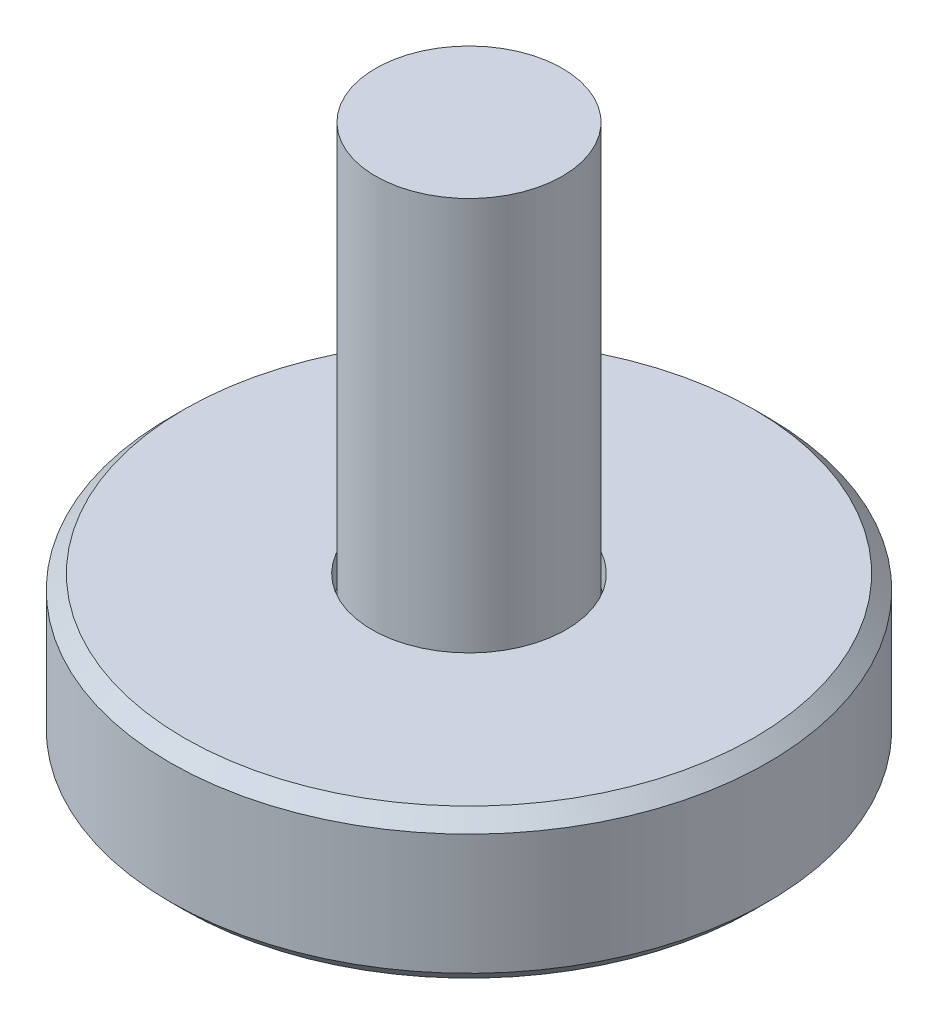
ISO-10303-21;
HEADER;
FILE_DESCRIPTION(('STEP AP214'),'2;1');
FILE_NAME('part.step','',(''),(''),'','','');
FILE_SCHEMA(('AUTOMOTIVE_DESIGN { 1 0 10303 214 1 1 1 1 }'));
ENDSEC;
DATA;
#1=APPLICATION_CONTEXT('core data for automotive mechanical design processes');
#2=APPLICATION_PROTOCOL_DEFINITION('international standard','automotive_design',2000,#1);
#3=PRODUCT_CONTEXT('',#1,'mechanical');
#4=PRODUCT('Part','Part','',(#3));
#5=PRODUCT_RELATED_PRODUCT_CATEGORY('part','',(#4));
#6=PRODUCT_DEFINITION_FORMATION('','',#4);
#7=PRODUCT_DEFINITION_CONTEXT('part definition',#1,'design');
#8=PRODUCT_DEFINITION('design','',#6,#7);
#9=PRODUCT_DEFINITION_SHAPE('','',#8);
#10=(LENGTH_UNIT() NAMED_UNIT(*) SI_UNIT(.MILLI.,.METRE.));
#11=(NAMED_UNIT(*) PLANE_ANGLE_UNIT() SI_UNIT($,.RADIAN.));
#12=(NAMED_UNIT(*) SI_UNIT($,.STERADIAN.) SOLID_ANGLE_UNIT());
#13=UNCERTAINTY_MEASURE_WITH_UNIT(LENGTH_MEASURE(1.E-05),#10,'distance_accuracy_value','');
#14=(GEOMETRIC_REPRESENTATION_CONTEXT(3) GLOBAL_UNCERTAINTY_ASSIGNED_CONTEXT((#13)) GLOBAL_UNIT_ASSIGNED_CONTEXT((#10,
#11,#12)) REPRESENTATION_CONTEXT('',''));
#15=CARTESIAN_POINT('',(0.,0.,0.));
#16=DIRECTION('',(0.,0.,1.));
#17=DIRECTION('',(1.,0.,0.));
#18=AXIS2_PLACEMENT_3D('',#15,#16,#17);
#19=CARTESIAN_POINT('',(0.,14.45,0.));
#20=DIRECTION('',(0.,1.,0.));
#21=DIRECTION('',(1.,0.,0.));
#22=AXIS2_PLACEMENT_3D('',#19,#20,#21);
#23=PLANE('',#22);
#24=CARTESIAN_POINT('',(0.,14.45,0.));
#25=DIRECTION('',(0.,1.,0.));
#26=DIRECTION('',(1.,0.,0.));
#27=AXIS2_PLACEMENT_3D('',#24,#25,#26);
#28=CIRCLE('',#27,2.5);
#29=CARTESIAN_POINT('',(2.5,14.45,0.));
#30=VERTEX_POINT('',#29);
#31=EDGE_CURVE('E12',#30,#30,#28,.T.);
#32=ORIENTED_EDGE('',*,*,#31,.T.);
#33=EDGE_LOOP('',(#32));
#34=FACE_BOUND('',#33,.T.);
#35=ADVANCED_FACE('F47',(#34),#23,.T.);
#36=CARTESIAN_POINT('',(0.,14.45,0.));
#37=DIRECTION('',(0.,1.,0.));
#38=DIRECTION('',(1.,0.,0.));
#39=AXIS2_PLACEMENT_3D('',#36,#37,#38);
#40=CYLINDRICAL_SURFACE('',#39,2.5);
#41=CARTESIAN_POINT('',(0.,3.25,0.));
#42=DIRECTION('',(0.,1.,0.));
#43=DIRECTION('',(1.,0.,0.));
#44=AXIS2_PLACEMENT_3D('',#41,#42,#43);
#45=CIRCLE('',#44,2.5);
#46=CARTESIAN_POINT('',(2.5,3.25,0.));
#47=VERTEX_POINT('',#46);
#48=EDGE_CURVE('E54',#47,#47,#45,.T.);
#49=ORIENTED_EDGE('',*,*,#48,.T.);
#50=EDGE_LOOP('',(#49));
#51=FACE_BOUND('',#50,.T.);
#52=ORIENTED_EDGE('',*,*,#31,.F.);
#53=EDGE_LOOP('',(#52));
#54=FACE_BOUND('',#53,.T.);
#55=ADVANCED_FACE('F161',(#51,#54),#40,.T.);
#56=CARTESIAN_POINT('',(0.,3.25,0.));
#57=DIRECTION('',(0.,-1.,0.));
#58=DIRECTION('',(-1.,0.,0.));
#59=AXIS2_PLACEMENT_3D('',#56,#57,#58);
#60=CONICAL_SURFACE('',#59,2.5,0.78539816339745);
#61=CARTESIAN_POINT('',(0.,0.750000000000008,0.));
#62=DIRECTION('',(0.,1.,0.));
#63=DIRECTION('',(1.,0.,0.));
#64=AXIS2_PLACEMENT_3D('',#61,#62,#63);
#65=CIRCLE('',#64,5.);
#66=CARTESIAN_POINT('',(5.,0.750000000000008,0.));
#67=VERTEX_POINT('',#66);
#68=EDGE_CURVE('E156',#67,#67,#65,.T.);
#69=ORIENTED_EDGE('',*,*,#68,.T.);
#70=EDGE_LOOP('',(#69));
#71=FACE_BOUND('',#70,.T.);
#72=ORIENTED_EDGE('',*,*,#48,.F.);
#73=EDGE_LOOP('',(#72));
#74=FACE_BOUND('',#73,.T.);
#75=ADVANCED_FACE('F164',(#71,#74),#60,.T.);
#76=CARTESIAN_POINT('',(0.,14.45,0.));
#77=DIRECTION('',(0.,1.,0.));
#78=DIRECTION('',(1.,0.,0.));
#79=AXIS2_PLACEMENT_3D('',#76,#77,#78);
#80=CYLINDRICAL_SURFACE('',#79,5.);
#81=CARTESIAN_POINT('',(0.,0.449999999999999,0.));
#82=DIRECTION('',(0.,1.,0.));
#83=DIRECTION('',(1.,0.,0.));
#84=AXIS2_PLACEMENT_3D('',#81,#82,#83);
#85=CIRCLE('',#84,5.);
#86=CARTESIAN_POINT('',(5.,0.449999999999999,0.));
#87=VERTEX_POINT('',#86);
#88=EDGE_CURVE('E148',#87,#87,#85,.T.);
#89=ORIENTED_EDGE('',*,*,#88,.T.);
#90=EDGE_LOOP('',(#89));
#91=FACE_BOUND('',#90,.T.);
#92=ORIENTED_EDGE('',*,*,#68,.F.);
#93=EDGE_LOOP('',(#92));
#94=FACE_BOUND('',#93,.T.);
#95=ADVANCED_FACE('F166',(#91,#94),#80,.T.);
#96=CARTESIAN_POINT('',(0.,0.449999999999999,5.));
#97=DIRECTION('',(0.,-1.,0.));
#98=DIRECTION('',(-1.,0.,0.));
#99=AXIS2_PLACEMENT_3D('',#96,#97,#98);
#100=PLANE('',#99);
#101=DIRECTION('',(0.866025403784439,0.,0.5));
#102=VECTOR('',#101,1.);
#103=CARTESIAN_POINT('',(0.,0.449999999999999,-1.73205080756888));
#104=LINE('',#103,#102);
#105=CARTESIAN_POINT('',(0.,0.449999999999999,-1.73205080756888));
#106=VERTEX_POINT('',#105);
#107=CARTESIAN_POINT('',(1.5,0.449999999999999,-0.866025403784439));
#108=VERTEX_POINT('',#107);
#109=EDGE_CURVE('E61',#106,#108,#104,.T.);
#110=ORIENTED_EDGE('',*,*,#109,.F.);
#111=DIRECTION('',(0.866025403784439,0.,-0.5));
#112=VECTOR('',#111,1.);
#113=CARTESIAN_POINT('',(-1.5,0.449999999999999,-0.866025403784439));
#114=LINE('',#113,#112);
#115=CARTESIAN_POINT('',(-1.5,0.449999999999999,-0.866025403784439));
#116=VERTEX_POINT('',#115);
#117=EDGE_CURVE('E144',#116,#106,#114,.T.);
#118=ORIENTED_EDGE('',*,*,#117,.F.);
#119=DIRECTION('',(0.,0.,-1.));
#120=VECTOR('',#119,1.);
#121=CARTESIAN_POINT('',(-1.5,0.449999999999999,0.866025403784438));
#122=LINE('',#121,#120);
#123=CARTESIAN_POINT('',(-1.5,0.449999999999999,0.866025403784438));
#124=VERTEX_POINT('',#123);
#125=EDGE_CURVE('E142',#124,#116,#122,.T.);
#126=ORIENTED_EDGE('',*,*,#125,.F.);
#127=DIRECTION('',(-0.866025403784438,0.,-0.5));
#128=VECTOR('',#127,1.);
#129=CARTESIAN_POINT('',(0.,0.449999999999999,1.73205080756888));
#130=LINE('',#129,#128);
#131=CARTESIAN_POINT('',(0.,0.449999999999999,1.73205080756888));
#132=VERTEX_POINT('',#131);
#133=EDGE_CURVE('E109',#132,#124,#130,.T.);
#134=ORIENTED_EDGE('',*,*,#133,.F.);
#135=DIRECTION('',(-0.866025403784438,0.,0.5));
#136=VECTOR('',#135,1.);
#137=CARTESIAN_POINT('',(1.5,0.449999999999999,0.866025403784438));
#138=LINE('',#137,#136);
#139=CARTESIAN_POINT('',(1.5,0.449999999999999,0.866025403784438));
#140=VERTEX_POINT('',#139);
#141=EDGE_CURVE('E138',#140,#132,#138,.T.);
#142=ORIENTED_EDGE('',*,*,#141,.F.);
#143=DIRECTION('',(0.,0.,1.));
#144=VECTOR('',#143,1.);
#145=CARTESIAN_POINT('',(1.5,0.449999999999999,-0.866025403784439));
#146=LINE('',#145,#144);
#147=EDGE_CURVE('E135',#108,#140,#146,.T.);
#148=ORIENTED_EDGE('',*,*,#147,.F.);
#149=EDGE_LOOP('',(#110,#118,#126,#134,#142,#148));
#150=FACE_BOUND('',#149,.T.);
#151=ORIENTED_EDGE('',*,*,#88,.F.);
#152=EDGE_LOOP('',(#151));
#153=FACE_BOUND('',#152,.T.);
#154=ADVANCED_FACE('F173',(#150,#153),#100,.T.);
#155=CARTESIAN_POINT('',(0.,2.95,-1.73205080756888));
#156=DIRECTION('',(0.5,0.,-0.866025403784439));
#157=DIRECTION('',(-0.866025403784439,0.,-0.5));
#158=AXIS2_PLACEMENT_3D('',#155,#156,#157);
#159=PLANE('',#158);
#160=ORIENTED_EDGE('',*,*,#109,.T.);
#161=DIRECTION('',(0.,-1.,0.));
#162=VECTOR('',#161,1.);
#163=CARTESIAN_POINT('',(1.5,2.95,-0.866025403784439));
#164=LINE('',#163,#162);
#165=CARTESIAN_POINT('',(1.5,2.95,-0.866025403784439));
#166=VERTEX_POINT('',#165);
#167=EDGE_CURVE('E91',#166,#108,#164,.T.);
#168=ORIENTED_EDGE('',*,*,#167,.F.);
#169=DIRECTION('',(0.866025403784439,0.,0.5));
#170=VECTOR('',#169,1.);
#171=CARTESIAN_POINT('',(0.,2.95,-1.73205080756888));
#172=LINE('',#171,#170);
#173=CARTESIAN_POINT('',(0.,2.95,-1.73205080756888));
#174=VERTEX_POINT('',#173);
#175=EDGE_CURVE('E146',#174,#166,#172,.T.);
#176=ORIENTED_EDGE('',*,*,#175,.F.);
#177=DIRECTION('',(0.,-1.,0.));
#178=VECTOR('',#177,1.);
#179=CARTESIAN_POINT('',(0.,2.95,-1.73205080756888));
#180=LINE('',#179,#178);
#181=EDGE_CURVE('E69',#174,#106,#180,.T.);
#182=ORIENTED_EDGE('',*,*,#181,.T.);
#183=EDGE_LOOP('',(#160,#168,#176,#182));
#184=FACE_BOUND('',#183,.T.);
#185=ADVANCED_FACE('F204',(#184),#159,.F.);
#186=CARTESIAN_POINT('',(-1.5,2.95,-0.866025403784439));
#187=DIRECTION('',(-0.5,0.,-0.866025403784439));
#188=DIRECTION('',(-0.866025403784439,0.,0.5));
#189=AXIS2_PLACEMENT_3D('',#186,#187,#188);
#190=PLANE('',#189);
#191=ORIENTED_EDGE('',*,*,#117,.T.);
#192=ORIENTED_EDGE('',*,*,#181,.F.);
#193=DIRECTION('',(0.866025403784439,0.,-0.5));
#194=VECTOR('',#193,1.);
#195=CARTESIAN_POINT('',(-1.5,2.95,-0.866025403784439));
#196=LINE('',#195,#194);
#197=CARTESIAN_POINT('',(-1.5,2.95,-0.866025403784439));
#198=VERTEX_POINT('',#197);
#199=EDGE_CURVE('E121',#198,#174,#196,.T.);
#200=ORIENTED_EDGE('',*,*,#199,.F.);
#201=DIRECTION('',(0.,-1.,0.));
#202=VECTOR('',#201,1.);
#203=CARTESIAN_POINT('',(-1.5,2.95,-0.866025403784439));
#204=LINE('',#203,#202);
#205=EDGE_CURVE('E113',#198,#116,#204,.T.);
#206=ORIENTED_EDGE('',*,*,#205,.T.);
#207=EDGE_LOOP('',(#191,#192,#200,#206));
#208=FACE_BOUND('',#207,.T.);
#209=ADVANCED_FACE('F214',(#208),#190,.F.);
#210=CARTESIAN_POINT('',(-1.5,2.95,0.866025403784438));
#211=DIRECTION('',(-1.,0.,0.));
#212=DIRECTION('',(0.,0.,1.));
#213=AXIS2_PLACEMENT_3D('',#210,#211,#212);
#214=PLANE('',#213);
#215=ORIENTED_EDGE('',*,*,#125,.T.);
#216=ORIENTED_EDGE('',*,*,#205,.F.);
#217=DIRECTION('',(0.,0.,-1.));
#218=VECTOR('',#217,1.);
#219=CARTESIAN_POINT('',(-1.5,2.95,0.866025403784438));
#220=LINE('',#219,#218);
#221=CARTESIAN_POINT('',(-1.5,2.95,0.866025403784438));
#222=VERTEX_POINT('',#221);
#223=EDGE_CURVE('E117',#222,#198,#220,.T.);
#224=ORIENTED_EDGE('',*,*,#223,.F.);
#225=DIRECTION('',(0.,-1.,0.));
#226=VECTOR('',#225,1.);
#227=CARTESIAN_POINT('',(-1.5,2.95,0.866025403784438));
#228=LINE('',#227,#226);
#229=EDGE_CURVE('E102',#222,#124,#228,.T.);
#230=ORIENTED_EDGE('',*,*,#229,.T.);
#231=EDGE_LOOP('',(#215,#216,#224,#230));
#232=FACE_BOUND('',#231,.T.);
#233=ADVANCED_FACE('F118',(#232),#214,.F.);
#234=CARTESIAN_POINT('',(0.,2.95,1.73205080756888));
#235=DIRECTION('',(-0.5,0.,0.866025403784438));
#236=DIRECTION('',(0.866025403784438,0.,0.5));
#237=AXIS2_PLACEMENT_3D('',#234,#235,#236);
#238=PLANE('',#237);
#239=ORIENTED_EDGE('',*,*,#133,.T.);
#240=ORIENTED_EDGE('',*,*,#229,.F.);
#241=DIRECTION('',(-0.866025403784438,0.,-0.5));
#242=VECTOR('',#241,1.);
#243=CARTESIAN_POINT('',(0.,2.95,1.73205080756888));
#244=LINE('',#243,#242);
#245=CARTESIAN_POINT('',(0.,2.95,1.73205080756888));
#246=VERTEX_POINT('',#245);
#247=EDGE_CURVE('E106',#246,#222,#244,.T.);
#248=ORIENTED_EDGE('',*,*,#247,.F.);
#249=DIRECTION('',(0.,-1.,0.));
#250=VECTOR('',#249,1.);
#251=CARTESIAN_POINT('',(0.,2.95,1.73205080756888));
#252=LINE('',#251,#250);
#253=EDGE_CURVE('E114',#246,#132,#252,.T.);
#254=ORIENTED_EDGE('',*,*,#253,.T.);
#255=EDGE_LOOP('',(#239,#240,#248,#254));
#256=FACE_BOUND('',#255,.T.);
#257=ADVANCED_FACE('F104',(#256),#238,.F.);
#258=CARTESIAN_POINT('',(1.5,2.95,0.866025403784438));
#259=DIRECTION('',(0.5,0.,0.866025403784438));
#260=DIRECTION('',(0.866025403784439,0.,-0.5));
#261=AXIS2_PLACEMENT_3D('',#258,#259,#260);
#262=PLANE('',#261);
#263=ORIENTED_EDGE('',*,*,#141,.T.);
#264=ORIENTED_EDGE('',*,*,#253,.F.);
#265=DIRECTION('',(-0.866025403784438,0.,0.5));
#266=VECTOR('',#265,1.);
#267=CARTESIAN_POINT('',(1.5,2.95,0.866025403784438));
#268=LINE('',#267,#266);
#269=CARTESIAN_POINT('',(1.5,2.95,0.866025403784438));
#270=VERTEX_POINT('',#269);
#271=EDGE_CURVE('E127',#270,#246,#268,.T.);
#272=ORIENTED_EDGE('',*,*,#271,.F.);
#273=DIRECTION('',(0.,-1.,0.));
#274=VECTOR('',#273,1.);
#275=CARTESIAN_POINT('',(1.5,2.95,0.866025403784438));
#276=LINE('',#275,#274);
#277=EDGE_CURVE('E151',#270,#140,#276,.T.);
#278=ORIENTED_EDGE('',*,*,#277,.T.);
#279=EDGE_LOOP('',(#263,#264,#272,#278));
#280=FACE_BOUND('',#279,.T.);
#281=ADVANCED_FACE('F239',(#280),#262,.F.);
#282=CARTESIAN_POINT('',(1.5,2.95,-0.866025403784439));
#283=DIRECTION('',(1.,0.,0.));
#284=DIRECTION('',(0.,-1.,0.));
#285=AXIS2_PLACEMENT_3D('',#282,#283,#284);
#286=PLANE('',#285);
#287=ORIENTED_EDGE('',*,*,#147,.T.);
#288=ORIENTED_EDGE('',*,*,#277,.F.);
#289=DIRECTION('',(0.,0.,1.));
#290=VECTOR('',#289,1.);
#291=CARTESIAN_POINT('',(1.5,2.95,-0.866025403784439));
#292=LINE('',#291,#290);
#293=EDGE_CURVE('E129',#166,#270,#292,.T.);
#294=ORIENTED_EDGE('',*,*,#293,.F.);
#295=ORIENTED_EDGE('',*,*,#167,.T.);
#296=EDGE_LOOP('',(#287,#288,#294,#295));
#297=FACE_BOUND('',#296,.T.);
#298=ADVANCED_FACE('F248',(#297),#286,.F.);
#299=CARTESIAN_POINT('',(3.,2.95,0.));
#300=DIRECTION('',(0.,-1.,0.));
#301=DIRECTION('',(-1.,0.,0.));
#302=AXIS2_PLACEMENT_3D('',#299,#300,#301);
#303=PLANE('',#302);
#304=ORIENTED_EDGE('',*,*,#175,.T.);
#305=ORIENTED_EDGE('',*,*,#293,.T.);
#306=ORIENTED_EDGE('',*,*,#271,.T.);
#307=ORIENTED_EDGE('',*,*,#247,.T.);
#308=ORIENTED_EDGE('',*,*,#223,.T.);
#309=ORIENTED_EDGE('',*,*,#199,.T.);
#310=EDGE_LOOP('',(#304,#305,#306,#307,#308,#309));
#311=FACE_BOUND('',#310,.T.);
#312=ADVANCED_FACE('F124',(#311),#303,.T.);
#313=CLOSED_SHELL('',(#35,#55,#75,#95,#154,#185,#209,#233,#257,#281,#298,#312));
#314=MANIFOLD_SOLID_BREP('B2',#313);
#315=CARTESIAN_POINT('',(0.,3.9878,0.));
#316=DIRECTION('',(0.,-1.,0.));
#317=DIRECTION('',(0.,0.,-1.));
#318=AXIS2_PLACEMENT_3D('',#315,#316,#317);
#319=CYLINDRICAL_SURFACE('',#318,8.001);
#320=CARTESIAN_POINT('',(0.,0.381000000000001,0.));
#321=DIRECTION('',(0.,1.,0.));
#322=DIRECTION('',(0.,0.,1.));
#323=AXIS2_PLACEMENT_3D('',#320,#321,#322);
#324=CIRCLE('',#323,8.001);
#325=CARTESIAN_POINT('',(0.,0.381000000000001,8.001));
#326=VERTEX_POINT('',#325);
#327=EDGE_CURVE('E294',#326,#326,#324,.T.);
#328=ORIENTED_EDGE('',*,*,#327,.T.);
#329=EDGE_LOOP('',(#328));
#330=FACE_BOUND('',#329,.T.);
#331=CARTESIAN_POINT('',(0.,3.60679999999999,0.));
#332=DIRECTION('',(0.,1.,0.));
#333=DIRECTION('',(0.,0.,1.));
#334=AXIS2_PLACEMENT_3D('',#331,#332,#333);
#335=CIRCLE('',#334,8.001);
#336=CARTESIAN_POINT('',(0.,3.60679999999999,-8.001));
#337=VERTEX_POINT('',#336);
#338=EDGE_CURVE('E298',#337,#337,#335,.F.);
#339=ORIENTED_EDGE('',*,*,#338,.T.);
#340=EDGE_LOOP('',(#339));
#341=FACE_BOUND('',#340,.T.);
#342=ADVANCED_FACE('F283',(#330,#341),#319,.T.);
#343=CARTESIAN_POINT('',(0.,3.9878,0.));
#344=DIRECTION('',(0.,1.,0.));
#345=DIRECTION('',(0.,0.,1.));
#346=AXIS2_PLACEMENT_3D('',#343,#344,#345);
#347=PLANE('',#346);
#348=CARTESIAN_POINT('',(0.,3.9878,0.));
#349=DIRECTION('',(0.,-1.,0.));
#350=DIRECTION('',(0.,0.,-1.));
#351=AXIS2_PLACEMENT_3D('',#348,#349,#350);
#352=CIRCLE('',#351,2.6);
#353=CARTESIAN_POINT('',(0.,3.9878,-2.6));
#354=VERTEX_POINT('',#353);
#355=EDGE_CURVE('E309',#354,#354,#352,.T.);
#356=ORIENTED_EDGE('',*,*,#355,.T.);
#357=EDGE_LOOP('',(#356));
#358=FACE_BOUND('',#357,.T.);
#359=CARTESIAN_POINT('',(0.,3.9878,0.));
#360=DIRECTION('',(0.,1.,0.));
#361=DIRECTION('',(0.,0.,1.));
#362=AXIS2_PLACEMENT_3D('',#359,#360,#361);
#363=CIRCLE('',#362,7.61999999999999);
#364=CARTESIAN_POINT('',(0.,3.9878,-7.61999999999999));
#365=VERTEX_POINT('',#364);
#366=EDGE_CURVE('E46',#365,#365,#363,.T.);
#367=ORIENTED_EDGE('',*,*,#366,.T.);
#368=EDGE_LOOP('',(#367));
#369=FACE_BOUND('',#368,.T.);
#370=ADVANCED_FACE('F313',(#358,#369),#347,.T.);
#371=CARTESIAN_POINT('',(0.,0.,0.));
#372=DIRECTION('',(0.,1.,0.));
#373=DIRECTION('',(0.,0.,1.));
#374=AXIS2_PLACEMENT_3D('',#371,#372,#373);
#375=PLANE('',#374);
#376=CARTESIAN_POINT('',(0.,0.,0.));
#377=DIRECTION('',(0.,-1.,0.));
#378=DIRECTION('',(0.,0.,-1.));
#379=AXIS2_PLACEMENT_3D('',#376,#377,#378);
#380=CIRCLE('',#379,5.75000000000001);
#381=CARTESIAN_POINT('',(0.,0.,-5.75000000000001));
#382=VERTEX_POINT('',#381);
#383=EDGE_CURVE('E303',#382,#382,#380,.T.);
#384=ORIENTED_EDGE('',*,*,#383,.F.);
#385=EDGE_LOOP('',(#384));
#386=FACE_BOUND('',#385,.T.);
#387=CARTESIAN_POINT('',(0.,0.,0.));
#388=DIRECTION('',(0.,1.,0.));
#389=DIRECTION('',(0.,0.,1.));
#390=AXIS2_PLACEMENT_3D('',#387,#388,#389);
#391=CIRCLE('',#390,7.62);
#392=CARTESIAN_POINT('',(0.,0.,7.62));
#393=VERTEX_POINT('',#392);
#394=EDGE_CURVE('E290',#393,#393,#391,.F.);
#395=ORIENTED_EDGE('',*,*,#394,.T.);
#396=EDGE_LOOP('',(#395));
#397=FACE_BOUND('',#396,.T.);
#398=ADVANCED_FACE('F327',(#386,#397),#375,.F.);
#399=CARTESIAN_POINT('',(0.,0.381000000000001,0.));
#400=DIRECTION('',(0.,1.,0.));
#401=DIRECTION('',(0.,0.,1.));
#402=AXIS2_PLACEMENT_3D('',#399,#400,#401);
#403=CONICAL_SURFACE('',#402,8.001,0.785398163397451);
#404=ORIENTED_EDGE('',*,*,#394,.F.);
#405=EDGE_LOOP('',(#404));
#406=FACE_BOUND('',#405,.T.);
#407=ORIENTED_EDGE('',*,*,#327,.F.);
#408=EDGE_LOOP('',(#407));
#409=FACE_BOUND('',#408,.T.);
#410=ADVANCED_FACE('F329',(#406,#409),#403,.T.);
#411=CARTESIAN_POINT('',(0.,3.9878,0.));
#412=DIRECTION('',(0.,-1.,0.));
#413=DIRECTION('',(0.,0.,-1.));
#414=AXIS2_PLACEMENT_3D('',#411,#412,#413);
#415=CONICAL_SURFACE('',#414,7.61999999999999,0.785398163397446);
#416=CARTESIAN_POINT('',(0.,3.60679999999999,-8.001));
#417=CARTESIAN_POINT('',(0.,3.61076874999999,-7.99703125));
#418=CARTESIAN_POINT('',(0.,3.61473749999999,-7.9930625));
#419=CARTESIAN_POINT('',(0.,3.62267499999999,-7.985125));
#420=CARTESIAN_POINT('',(0.,3.62664374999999,-7.98115625));
#421=CARTESIAN_POINT('',(0.,3.63458124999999,-7.97321875));
#422=CARTESIAN_POINT('',(0.,3.63854999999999,-7.96925));
#423=CARTESIAN_POINT('',(0.,3.64648749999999,-7.9613125));
#424=CARTESIAN_POINT('',(0.,3.65045624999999,-7.95734375));
#425=CARTESIAN_POINT('',(0.,3.65839374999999,-7.94940625));
#426=CARTESIAN_POINT('',(0.,3.66236249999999,-7.9454375));
#427=CARTESIAN_POINT('',(0.,3.67029999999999,-7.9375));
#428=CARTESIAN_POINT('',(0.,3.67426874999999,-7.93353125));
#429=CARTESIAN_POINT('',(0.,3.68220624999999,-7.92559375));
#430=CARTESIAN_POINT('',(0.,3.68617499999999,-7.921625));
#431=CARTESIAN_POINT('',(0.,3.69411249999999,-7.9136875));
#432=CARTESIAN_POINT('',(0.,3.69808124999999,-7.90971875));
#433=CARTESIAN_POINT('',(0.,3.70601874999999,-7.90178125));
#434=CARTESIAN_POINT('',(0.,3.70998749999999,-7.8978125));
#435=CARTESIAN_POINT('',(0.,3.71792499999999,-7.889875));
#436=CARTESIAN_POINT('',(0.,3.72189374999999,-7.88590625));
#437=CARTESIAN_POINT('',(0.,3.72983124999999,-7.87796875));
#438=CARTESIAN_POINT('',(0.,3.7338,-7.874));
#439=CARTESIAN_POINT('',(0.,3.7417375,-7.8660625));
#440=CARTESIAN_POINT('',(0.,3.74570625,-7.86209375));
#441=CARTESIAN_POINT('',(0.,3.75364375,-7.85415625));
#442=CARTESIAN_POINT('',(0.,3.7576125,-7.8501875));
#443=CARTESIAN_POINT('',(0.,3.76555,-7.84225));
#444=CARTESIAN_POINT('',(0.,3.76951875,-7.83828125));
#445=CARTESIAN_POINT('',(0.,3.77745625,-7.83034375));
#446=CARTESIAN_POINT('',(0.,3.781425,-7.826375));
#447=CARTESIAN_POINT('',(0.,3.7893625,-7.8184375));
#448=CARTESIAN_POINT('',(0.,3.79333125,-7.81446875));
#449=CARTESIAN_POINT('',(0.,3.80126875,-7.80653125));
#450=CARTESIAN_POINT('',(0.,3.8052375,-7.8025625));
#451=CARTESIAN_POINT('',(0.,3.813175,-7.794625));
#452=CARTESIAN_POINT('',(0.,3.81714375,-7.79065625));
#453=CARTESIAN_POINT('',(0.,3.82508125,-7.78271875));
#454=CARTESIAN_POINT('',(0.,3.82905,-7.77875));
#455=CARTESIAN_POINT('',(0.,3.8369875,-7.7708125));
#456=CARTESIAN_POINT('',(0.,3.84095625,-7.76684375));
#457=CARTESIAN_POINT('',(0.,3.84889375,-7.75890625));
#458=CARTESIAN_POINT('',(0.,3.8528625,-7.7549375));
#459=CARTESIAN_POINT('',(0.,3.8608,-7.747));
#460=CARTESIAN_POINT('',(0.,3.86476875,-7.74303125));
#461=CARTESIAN_POINT('',(0.,3.87270625,-7.73509375));
#462=CARTESIAN_POINT('',(0.,3.876675,-7.731125));
#463=CARTESIAN_POINT('',(0.,3.8846125,-7.7231875));
#464=CARTESIAN_POINT('',(0.,3.88858125,-7.71921875));
#465=CARTESIAN_POINT('',(0.,3.89651875,-7.71128125));
#466=CARTESIAN_POINT('',(0.,3.9004875,-7.7073125));
#467=CARTESIAN_POINT('',(0.,3.908425,-7.699375));
#468=CARTESIAN_POINT('',(0.,3.91239375,-7.69540625));
#469=CARTESIAN_POINT('',(0.,3.92033125,-7.68746875));
#470=CARTESIAN_POINT('',(0.,3.9243,-7.6835));
#471=CARTESIAN_POINT('',(0.,3.9322375,-7.6755625));
#472=CARTESIAN_POINT('',(0.,3.93620625,-7.67159375));
#473=CARTESIAN_POINT('',(0.,3.94414375,-7.66365625));
#474=CARTESIAN_POINT('',(0.,3.9481125,-7.6596875));
#475=CARTESIAN_POINT('',(0.,3.95605,-7.65175));
#476=CARTESIAN_POINT('',(0.,3.96001875,-7.64778125));
#477=CARTESIAN_POINT('',(0.,3.96795625,-7.63984375));
#478=CARTESIAN_POINT('',(0.,3.971925,-7.635875));
#479=CARTESIAN_POINT('',(0.,3.9798625,-7.6279375));
#480=CARTESIAN_POINT('',(0.,3.98383125,-7.62396875));
#481=CARTESIAN_POINT('',(0.,3.9878,-7.61999999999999));
#482=B_SPLINE_CURVE_WITH_KNOTS('',3,(#416,#417,#418,#419,#420,#421,#422,#423,#424,#425,#426,
#427,#428,#429,#430,#431,#432,#433,#434,#435,#436,#437,#438,#439,#440,#441,#442,#443,#444,#445,
#446,#447,#448,#449,#450,#451,#452,#453,#454,#455,#456,#457,#458,#459,#460,#461,#462,#463,#464,
#465,#466,#467,#468,#469,#470,#471,#472,#473,#474,#475,#476,#477,#478,#479,#480,#481),
.UNSPECIFIED.,.F.,.F.,(4,2,2,2,2,2,2,2,2,2,2,2,2,2,2,2,2,2,2,2,2,2,2,2,2,2,2,2,2,2,2,2,4),(0.,
0.0168379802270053,0.0336759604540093,0.0505139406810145,0.0673519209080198,0.0841899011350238,
0.101027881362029,0.117865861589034,0.13470384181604,0.151541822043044,0.168379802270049,
0.185217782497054,0.202055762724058,0.218893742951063,0.235731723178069,0.252569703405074,
0.269407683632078,0.286245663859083,0.303083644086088,0.319921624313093,0.336759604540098,
0.353597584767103,0.370435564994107,0.387273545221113,0.404111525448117,0.420949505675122,
0.437787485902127,0.454625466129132,0.471463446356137,0.488301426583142,0.505139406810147,
0.521977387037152,0.538815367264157),.UNSPECIFIED.);
#483=EDGE_CURVE('BSEAM285',#337,#365,#482,.T.);
#484=ORIENTED_EDGE('',*,*,#338,.F.);
#485=ORIENTED_EDGE('',*,*,#366,.F.);
#486=ORIENTED_EDGE('',*,*,#483,.T.);
#487=ORIENTED_EDGE('',*,*,#483,.F.);
#488=EDGE_LOOP('',(#484,#486,#485,#487));
#489=FACE_BOUND('',#488,.T.);
#490=ADVANCED_FACE('F285',(#489),#415,.T.);
#491=CARTESIAN_POINT('',(0.,0.,0.));
#492=DIRECTION('',(0.,-1.,0.));
#493=DIRECTION('',(0.,0.,-1.));
#494=AXIS2_PLACEMENT_3D('',#491,#492,#493);
#495=CONICAL_SURFACE('',#494,5.75000000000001,0.78539816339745);
#496=CARTESIAN_POINT('',(0.,3.15,0.));
#497=DIRECTION('',(0.,-1.,0.));
#498=DIRECTION('',(0.,0.,-1.));
#499=AXIS2_PLACEMENT_3D('',#496,#497,#498);
#500=CIRCLE('',#499,2.6);
#501=CARTESIAN_POINT('',(0.,3.15,-2.6));
#502=VERTEX_POINT('',#501);
#503=EDGE_CURVE('E306',#502,#502,#500,.T.);
#504=ORIENTED_EDGE('',*,*,#503,.F.);
#505=EDGE_LOOP('',(#504));
#506=FACE_BOUND('',#505,.T.);
#507=ORIENTED_EDGE('',*,*,#383,.T.);
#508=EDGE_LOOP('',(#507));
#509=FACE_BOUND('',#508,.T.);
#510=ADVANCED_FACE('F318',(#506,#509),#495,.F.);
#511=CARTESIAN_POINT('',(0.,-2.0500103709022,0.));
#512=DIRECTION('',(0.,-1.,0.));
#513=DIRECTION('',(0.,0.,-1.));
#514=AXIS2_PLACEMENT_3D('',#511,#512,#513);
#515=CYLINDRICAL_SURFACE('',#514,2.6);
#516=ORIENTED_EDGE('',*,*,#355,.F.);
#517=EDGE_LOOP('',(#516));
#518=FACE_BOUND('',#517,.T.);
#519=ORIENTED_EDGE('',*,*,#503,.T.);
#520=EDGE_LOOP('',(#519));
#521=FACE_BOUND('',#520,.T.);
#522=ADVANCED_FACE('F315',(#518,#521),#515,.F.);
#523=CLOSED_SHELL('',(#342,#370,#398,#410,#490,#510,#522));
#524=MANIFOLD_SOLID_BREP('B6',#523);
#525=ADVANCED_BREP_SHAPE_REPRESENTATION('',(#18,#314,#524),#14);
#526=SHAPE_DEFINITION_REPRESENTATION(#9,#525);
ENDSEC;
END-ISO-10303-21;
